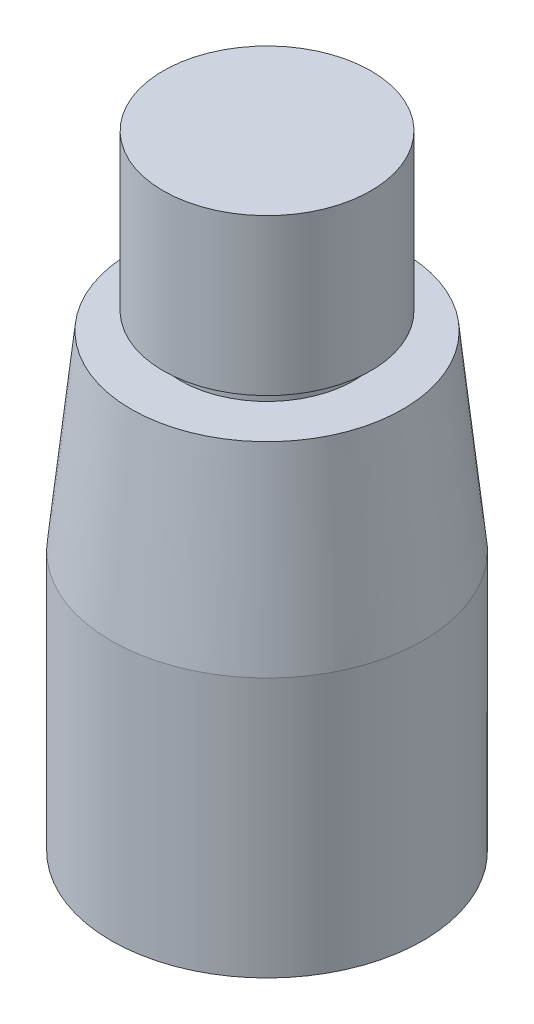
from build123d import *


with BuildPart() as part:
    # Sketch1 → Revolve1 (revolve)
    with BuildSketch(Plane.XY, mode=Mode.PRIVATE) as revolve1_sk:
        Polygon((0, 0), (-9, 0), (-9, 15), (-7.843853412, 26), (-5, 26), (-5, 27), (-6, 27), (-6, 36), (0, 36), align=None)
    revolve(revolve1_sk.sketch.rotate(Axis((0, 85.10264496, 0), (0, -1, 0)), 270), axis=Axis((0, 85.10264496, 0), (0, -1, 0)))


solid = part.part
